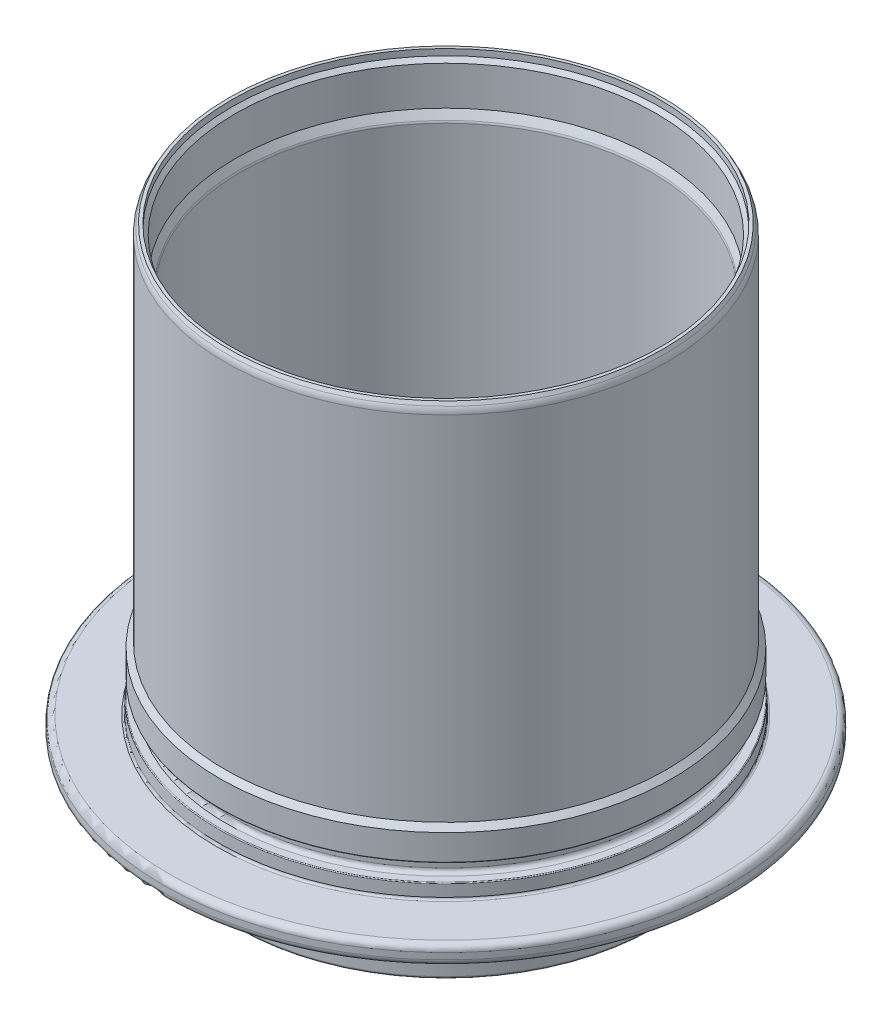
from build123d import *


with BuildPart() as part:
    # Esquisse1 → R_volution1 (revolve)
    with BuildSketch(Plane.XY):
        with BuildLine():
            Line((-120.256684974, 137.386860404), (-120.256684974, 54.629466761))
            ThreePointArc((-120.256684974, 54.629466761), (-119.343239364, 50.037265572), (-116.741966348, 46.144185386))
            Line((-116.741966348, 46.144185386), (-111.064578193, 40.466797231))
            ThreePointArc((-111.064578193, 40.466797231), (-110.847805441, 40.142373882), (-110.771684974, 39.75969045))
            Line((-110.771684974, 39.75969045), (-110.771684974, 39.273957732))
            ThreePointArc((-110.771684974, 39.273957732), (-110.888842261, 38.99111502), (-111.171684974, 38.873957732))
            Line((-111.171684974, 38.873957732), (-113.496714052, 38.873957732))
            ThreePointArc((-113.496714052, 38.873957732), (-114.557374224, 38.434617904), (-114.996714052, 37.373957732))
            Line((-114.996714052, 37.373957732), (-114.996714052, 34.373957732))
            ThreePointArc((-114.996714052, 34.373957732), (-114.557374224, 33.31329756), (-113.496714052, 32.873957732))
            Line((-113.496714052, 32.873957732), (-110.521684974, 32.873957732))
            ThreePointArc((-110.521684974, 32.873957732), (-110.238842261, 32.756800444), (-110.121684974, 32.473957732))
            Line((-110.121684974, 32.473957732), (-110.121684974, 31.641948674))
            ThreePointArc((-110.121684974, 31.641948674), (-110.155759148, 31.383129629), (-110.25565957, 31.141948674))
            Line((-110.25565957, 31.141948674), (-110.699059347, 30.373957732))
            Line((-110.699059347, 30.373957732), (-120.471684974, 30.373957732))
            ThreePointArc((-120.471684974, 30.373957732), (-120.825238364, 30.520404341), (-120.971684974, 30.873957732))
            Line((-120.971684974, 30.873957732), (-120.971684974, 34.585843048))
            ThreePointArc((-120.971684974, 34.585843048), (-120.920573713, 34.974071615), (-120.77072308, 35.335843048))
            Line((-120.77072308, 35.335843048), (-119.272646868, 37.930587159))
            ThreePointArc((-119.272646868, 37.930587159), (-119.122796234, 38.292358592), (-119.071684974, 38.680587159))
            Line((-119.071684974, 38.680587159), (-119.071684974, 40.876739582))
            ThreePointArc((-119.071684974, 40.876739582), (-119.122796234, 41.26496815), (-119.272646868, 41.626739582))
            Line((-119.272646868, 41.626739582), (-121.003091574, 44.623957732))
            ThreePointArc((-121.003091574, 44.623957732), (-121.55212968, 45.172995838), (-122.30212968, 45.373957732))
            Line((-122.30212968, 45.373957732), (-137.171684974, 45.373957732))
            ThreePointArc((-137.171684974, 45.373957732), (-138.232345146, 45.81329756), (-138.671684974, 46.873957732))
            Line((-138.671684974, 46.873957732), (-138.671684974, 48.373957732))
            ThreePointArc((-138.671684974, 48.373957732), (-138.232345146, 49.434617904), (-137.171684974, 49.873957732))
            Line((-137.171684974, 49.873957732), (-125.871684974, 49.873957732))
            ThreePointArc((-125.871684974, 49.873957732), (-125.518131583, 50.020404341), (-125.371684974, 50.373957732))
            Line((-125.371684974, 50.373957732), (-125.371684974, 53.173957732))
            ThreePointArc((-125.371684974, 53.173957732), (-125.31310633, 53.315379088), (-125.171684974, 53.373957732))
            Line((-125.171684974, 53.373957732), (-123.421684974, 53.373957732))
            ThreePointArc((-123.421684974, 53.373957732), (-122.714578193, 53.666850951), (-122.421684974, 54.373957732))
            Line((-122.421684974, 54.373957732), (-122.421684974, 56.323957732))
            ThreePointArc((-122.421684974, 56.323957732), (-122.714578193, 57.031064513), (-123.421684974, 57.323957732))
            Line((-123.421684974, 57.323957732), (-124.971684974, 57.323957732))
            ThreePointArc((-124.971684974, 57.323957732), (-125.11310633, 57.382536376), (-125.171684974, 57.523957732))
            Line((-125.171684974, 57.523957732), (-125.171684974, 63.623963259))
            Line((-125.171684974, 63.623963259), (-123.921684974, 64.873957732))
            Line((-123.921684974, 64.873957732), (-123.921684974, 149.070090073))
            ThreePointArc((-123.921684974, 149.070090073), (-123.819462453, 149.846547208), (-123.519761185, 150.570090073))
            Line((-123.519761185, 150.570090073), (-123.058227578, 151.36948973))
            Line((-123.058227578, 151.36948973), (-122.321684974, 151.365678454))
            Line((-122.321684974, 151.365678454), (-122.321684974, 149.865678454))
            Line((-122.321684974, 149.865678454), (-121.421684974, 148.965678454))
            Line((-121.421684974, 148.965678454), (-121.421684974, 139.672648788))
            Line((-121.421684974, 139.672648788), (-120.39065957, 137.886860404))
            ThreePointArc((-120.39065957, 137.886860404), (-120.290759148, 137.645679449), (-120.256684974, 137.386860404))
        make_face()
    revolve(axis=Axis((-71.171684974, 158.736724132, 0), (0, -1, 0)))


solid = part.part
